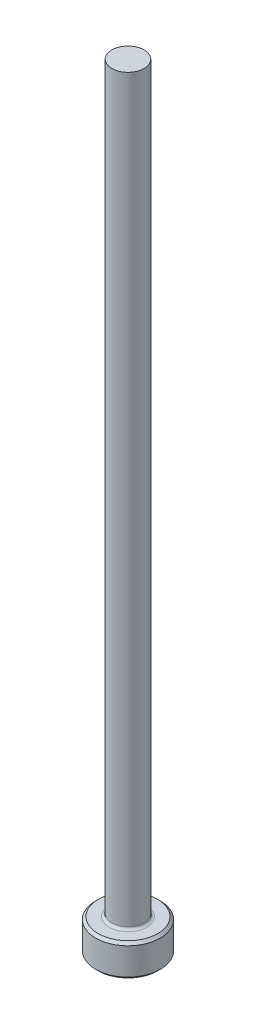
from build123d import *

# Parameters (mm, degrees)
CHAMFER1_SIZE = 0.254
FILLET1_R     = 0.254


with BuildPart() as part:
    # Sketch1 → Revolve1 (revolve)
    with BuildSketch(Plane.XY, mode=Mode.PRIVATE) as revolve1_sk:
        Polygon((0, 0), (-3.175, 0), (-3.175, 3.175), (-1.5875, 3.175), (-1.5875, 76.2), (0, 76.2), align=None)
    revolve(revolve1_sk.sketch.rotate(Axis((0, 259.958771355, 0), (0, -1, 0)), 270), axis=Axis((0, 259.958771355, 0), (0, -1, 0)))

    # Chamfer1
    chamfer1_edges = [part.edges().sort_by_distance(p)[0] for p in [
        (0, 3.175, -3.175),
        (0, 0, -3.175),
    ]]
    chamfer(chamfer1_edges, length=CHAMFER1_SIZE)

    # Fillet1
    fillet1_edges = [part.edges().sort_by_distance(p)[0] for p in [
        (0, 3.175, -1.5875),
    ]]
    fillet(fillet1_edges, radius=FILLET1_R)


solid = part.part
